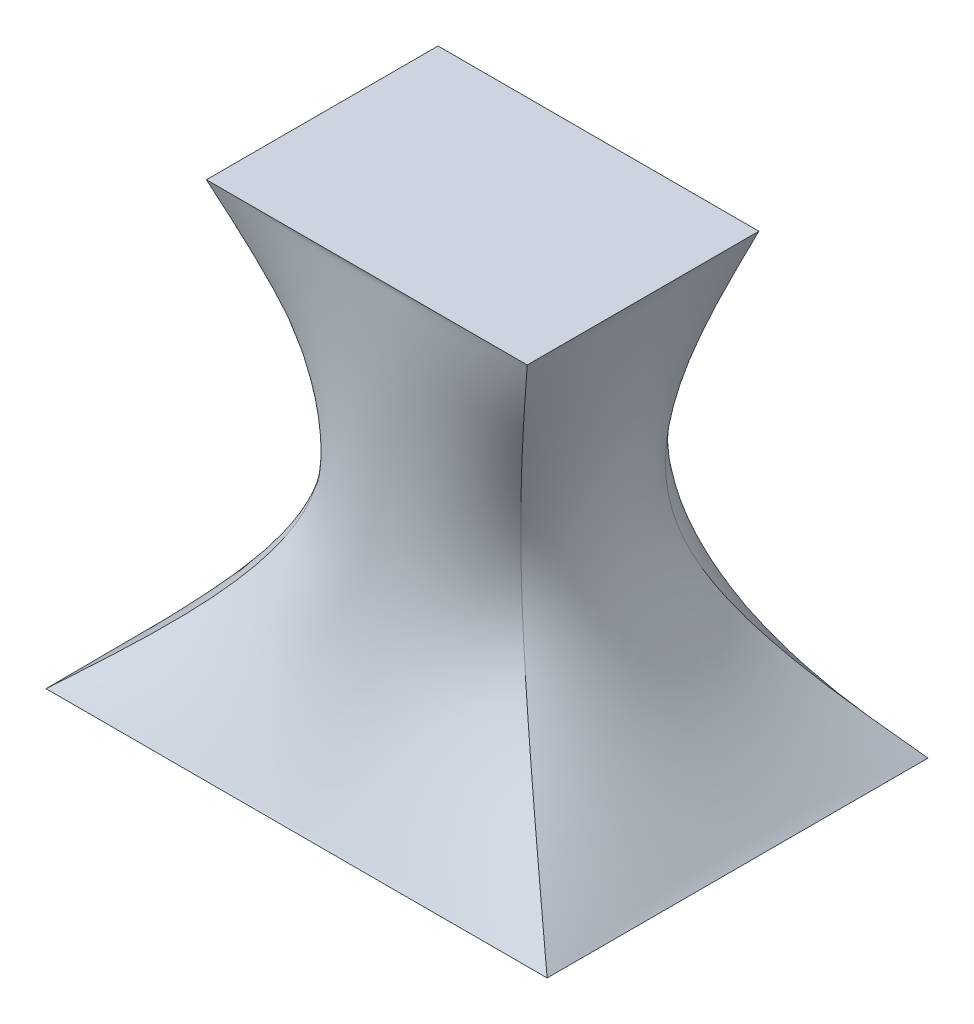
ISO-10303-21;
HEADER;
FILE_DESCRIPTION(('STEP AP214'),'2;1');
FILE_NAME('part.step','',(''),(''),'','','');
FILE_SCHEMA(('AUTOMOTIVE_DESIGN { 1 0 10303 214 1 1 1 1 }'));
ENDSEC;
DATA;
#1=APPLICATION_CONTEXT('core data for automotive mechanical design processes');
#2=APPLICATION_PROTOCOL_DEFINITION('international standard','automotive_design',2000,#1);
#3=PRODUCT_CONTEXT('',#1,'mechanical');
#4=PRODUCT('Part','Part','',(#3));
#5=PRODUCT_RELATED_PRODUCT_CATEGORY('part','',(#4));
#6=PRODUCT_DEFINITION_FORMATION('','',#4);
#7=PRODUCT_DEFINITION_CONTEXT('part definition',#1,'design');
#8=PRODUCT_DEFINITION('design','',#6,#7);
#9=PRODUCT_DEFINITION_SHAPE('','',#8);
#10=(LENGTH_UNIT() NAMED_UNIT(*) SI_UNIT(.MILLI.,.METRE.));
#11=(NAMED_UNIT(*) PLANE_ANGLE_UNIT() SI_UNIT($,.RADIAN.));
#12=(NAMED_UNIT(*) SI_UNIT($,.STERADIAN.) SOLID_ANGLE_UNIT());
#13=UNCERTAINTY_MEASURE_WITH_UNIT(LENGTH_MEASURE(1.E-05),#10,'distance_accuracy_value','');
#14=(GEOMETRIC_REPRESENTATION_CONTEXT(3) GLOBAL_UNCERTAINTY_ASSIGNED_CONTEXT((#13)) GLOBAL_UNIT_ASSIGNED_CONTEXT((#10,
#11,#12)) REPRESENTATION_CONTEXT('',''));
#15=CARTESIAN_POINT('',(0.,0.,0.));
#16=DIRECTION('',(0.,0.,1.));
#17=DIRECTION('',(1.,0.,0.));
#18=AXIS2_PLACEMENT_3D('',#15,#16,#17);
#19=CARTESIAN_POINT('',(-31.7563704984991,88.3809910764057,24.8139933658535));
#20=DIRECTION('',(0.,1.,0.));
#21=DIRECTION('',(0.,0.,1.));
#22=AXIS2_PLACEMENT_3D('',#19,#20,#21);
#23=PLANE('',#22);
#24=DIRECTION('',(0.,0.,1.));
#25=VECTOR('',#24,1.);
#26=CARTESIAN_POINT('',(-31.7563704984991,88.3809910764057,-20.532301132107));
#27=LINE('',#26,#25);
#28=CARTESIAN_POINT('',(-31.7563704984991,88.3809910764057,-20.532301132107));
#29=VERTEX_POINT('',#28);
#30=CARTESIAN_POINT('',(-31.7563704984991,88.3809910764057,24.8139933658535));
#31=VERTEX_POINT('',#30);
#32=EDGE_CURVE('E91',#29,#31,#27,.T.);
#33=ORIENTED_EDGE('',*,*,#32,.T.);
#34=DIRECTION('',(1.,0.,0.));
#35=VECTOR('',#34,1.);
#36=CARTESIAN_POINT('',(-31.7563704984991,88.3809910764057,24.8139933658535));
#37=LINE('',#36,#35);
#38=CARTESIAN_POINT('',(31.0591585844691,88.3809910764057,24.8139933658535));
#39=VERTEX_POINT('',#38);
#40=EDGE_CURVE('E108',#31,#39,#37,.T.);
#41=ORIENTED_EDGE('',*,*,#40,.T.);
#42=DIRECTION('',(0.,0.,-1.));
#43=VECTOR('',#42,1.);
#44=CARTESIAN_POINT('',(31.0591585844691,88.3809910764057,-20.532301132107));
#45=LINE('',#44,#43);
#46=CARTESIAN_POINT('',(31.0591585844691,88.3809910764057,-20.532301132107));
#47=VERTEX_POINT('',#46);
#48=EDGE_CURVE('E92',#39,#47,#45,.T.);
#49=ORIENTED_EDGE('',*,*,#48,.T.);
#50=DIRECTION('',(-1.,0.,0.));
#51=VECTOR('',#50,1.);
#52=CARTESIAN_POINT('',(-31.7563704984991,88.3809910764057,-20.532301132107));
#53=LINE('',#52,#51);
#54=EDGE_CURVE('E87',#47,#29,#53,.T.);
#55=ORIENTED_EDGE('',*,*,#54,.T.);
#56=EDGE_LOOP('',(#33,#41,#49,#55));
#57=FACE_BOUND('',#56,.T.);
#58=ADVANCED_FACE('F40',(#57),#23,.T.);
#59=CARTESIAN_POINT('',(-49.5440034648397,0.,38.4252172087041));
#60=DIRECTION('',(0.,1.,0.));
#61=DIRECTION('',(0.,0.,1.));
#62=AXIS2_PLACEMENT_3D('',#59,#60,#61);
#63=PLANE('',#62);
#64=DIRECTION('',(0.,0.,1.));
#65=VECTOR('',#64,1.);
#66=CARTESIAN_POINT('',(-49.5440034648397,0.,-36.1360553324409));
#67=LINE('',#66,#65);
#68=CARTESIAN_POINT('',(-49.5440034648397,0.,-36.1360553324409));
#69=VERTEX_POINT('',#68);
#70=CARTESIAN_POINT('',(-49.5440034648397,0.,38.4252172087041));
#71=VERTEX_POINT('',#70);
#72=EDGE_CURVE('E134',#69,#71,#67,.T.);
#73=ORIENTED_EDGE('',*,*,#72,.F.);
#74=DIRECTION('',(-1.,0.,0.));
#75=VECTOR('',#74,1.);
#76=CARTESIAN_POINT('',(-49.5440034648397,0.,-36.1360553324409));
#77=LINE('',#76,#75);
#78=CARTESIAN_POINT('',(48.5629340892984,0.,-36.1360553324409));
#79=VERTEX_POINT('',#78);
#80=EDGE_CURVE('E12',#79,#69,#77,.T.);
#81=ORIENTED_EDGE('',*,*,#80,.F.);
#82=DIRECTION('',(0.,0.,-1.));
#83=VECTOR('',#82,1.);
#84=CARTESIAN_POINT('',(48.5629340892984,0.,-36.1360553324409));
#85=LINE('',#84,#83);
#86=CARTESIAN_POINT('',(48.5629340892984,0.,38.4252172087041));
#87=VERTEX_POINT('',#86);
#88=EDGE_CURVE('E52',#87,#79,#85,.T.);
#89=ORIENTED_EDGE('',*,*,#88,.F.);
#90=DIRECTION('',(1.,0.,0.));
#91=VECTOR('',#90,1.);
#92=CARTESIAN_POINT('',(-49.5440034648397,0.,38.4252172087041));
#93=LINE('',#92,#91);
#94=EDGE_CURVE('E60',#71,#87,#93,.T.);
#95=ORIENTED_EDGE('',*,*,#94,.F.);
#96=EDGE_LOOP('',(#73,#81,#89,#95));
#97=FACE_BOUND('',#96,.T.);
#98=ADVANCED_FACE('F42',(#97),#63,.F.);
#99=CARTESIAN_POINT('',(48.5629340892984,0.,38.4252172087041));
#100=CARTESIAN_POINT('',(36.5326244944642,11.0374076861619,28.3981800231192));
#101=CARTESIAN_POINT('',(9.99117374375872,35.3883032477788,6.27637912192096));
#102=CARTESIAN_POINT('',(23.6121135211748,69.6493023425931,18.2613757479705));
#103=CARTESIAN_POINT('',(31.0591585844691,88.3809910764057,24.8139933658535));
#104=CARTESIAN_POINT('',(48.5629340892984,0.,13.5714596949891));
#105=CARTESIAN_POINT('',(39.7169107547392,11.0374076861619,10.354639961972));
#106=CARTESIAN_POINT('',(20.2006804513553,35.3883032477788,3.25764367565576));
#107=CARTESIAN_POINT('',(27.2209378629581,69.6493023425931,7.42184634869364));
#108=CARTESIAN_POINT('',(31.0591585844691,88.3809910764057,9.69856186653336));
#109=CARTESIAN_POINT('',(48.5629340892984,0.,-11.2822978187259));
#110=CARTESIAN_POINT('',(39.7169107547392,11.0374076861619,-9.26962336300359));
#111=CARTESIAN_POINT('',(20.2006804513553,35.3883032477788,-4.82923057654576));
#112=CARTESIAN_POINT('',(27.2209378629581,69.6493023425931,-5.20915282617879));
#113=CARTESIAN_POINT('',(31.0591585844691,88.3809910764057,-5.41686963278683));
#114=CARTESIAN_POINT('',(48.5629340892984,0.,-36.1360553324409));
#115=CARTESIAN_POINT('',(36.5326244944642,11.0374076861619,-27.3131634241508));
#116=CARTESIAN_POINT('',(9.99117374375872,35.3883032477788,-7.84796602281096));
#117=CARTESIAN_POINT('',(23.6121135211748,69.6493023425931,-16.0486822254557));
#118=CARTESIAN_POINT('',(31.0591585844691,88.3809910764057,-20.532301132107));
#119=B_SPLINE_SURFACE_WITH_KNOTS('',3,3,((#99,#100,#101,#102,#103),(#104,#105,#106,#107,#108),
(#109,#110,#111,#112,#113),(#114,#115,#116,#117,#118)),.UNSPECIFIED.,.F.,.F.,.F.,(4,4),(4,1,4),
(0.,1.),(0.,0.453264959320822,1.),.UNSPECIFIED.);
#120=CARTESIAN_POINT('',(48.5629340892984,0.,-36.1360553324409));
#121=CARTESIAN_POINT('',(36.5326244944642,11.0374076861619,-27.3131634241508));
#122=CARTESIAN_POINT('',(9.99117374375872,35.3883032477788,-7.84796602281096));
#123=CARTESIAN_POINT('',(23.6121135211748,69.6493023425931,-16.0486822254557));
#124=CARTESIAN_POINT('',(31.0591585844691,88.3809910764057,-20.532301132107));
#125=B_SPLINE_CURVE_WITH_KNOTS('',3,(#120,#121,#122,#123,#124),.UNSPECIFIED.,.F.,.F.,(4,1,4),
(0.,0.453264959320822,1.),.UNSPECIFIED.);
#126=EDGE_CURVE('E117',#79,#47,#125,.T.);
#127=CARTESIAN_POINT('',(48.5629340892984,0.,38.4252172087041));
#128=CARTESIAN_POINT('',(36.5326244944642,11.0374076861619,28.3981800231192));
#129=CARTESIAN_POINT('',(9.99117374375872,35.3883032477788,6.27637912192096));
#130=CARTESIAN_POINT('',(23.6121135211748,69.6493023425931,18.2613757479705));
#131=CARTESIAN_POINT('',(31.0591585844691,88.3809910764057,24.8139933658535));
#132=B_SPLINE_CURVE_WITH_KNOTS('',3,(#127,#128,#129,#130,#131),.UNSPECIFIED.,.F.,.F.,(4,1,4),
(0.,0.453264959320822,1.),.UNSPECIFIED.);
#133=EDGE_CURVE('E114',#39,#87,#132,.F.);
#134=ORIENTED_EDGE('',*,*,#88,.T.);
#135=ORIENTED_EDGE('',*,*,#126,.T.);
#136=ORIENTED_EDGE('',*,*,#48,.F.);
#137=ORIENTED_EDGE('',*,*,#133,.T.);
#138=EDGE_LOOP('',(#134,#135,#136,#137));
#139=FACE_BOUND('',#138,.T.);
#140=ADVANCED_FACE('F187',(#139),#119,.T.);
#141=CARTESIAN_POINT('',(48.5629340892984,0.,-36.1360553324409));
#142=CARTESIAN_POINT('',(36.5326244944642,11.0374076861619,-27.3131634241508));
#143=CARTESIAN_POINT('',(9.99117374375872,35.3883032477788,-7.84796602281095));
#144=CARTESIAN_POINT('',(23.6121135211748,69.6493023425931,-16.0486822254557));
#145=CARTESIAN_POINT('',(31.0591585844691,88.3809910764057,-20.532301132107));
#146=CARTESIAN_POINT('',(32.2117778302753,0.,-36.1360553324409));
#147=CARTESIAN_POINT('',(25.229593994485,11.0374076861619,-30.4088071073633));
#148=CARTESIAN_POINT('',(9.82539454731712,35.3883032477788,-17.7732655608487));
#149=CARTESIAN_POINT('',(16.7848988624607,69.6493023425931,-19.557045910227));
#150=CARTESIAN_POINT('',(20.5899037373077,88.3809910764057,-20.532301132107));
#151=CARTESIAN_POINT('',(15.8606215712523,0.,-36.1360553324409));
#152=CARTESIAN_POINT('',(12.5942103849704,11.0374076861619,-32.2350288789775));
#153=CARTESIAN_POINT('',(5.38780468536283,35.3883032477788,-23.6285253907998));
#154=CARTESIAN_POINT('',(8.44769799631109,69.6493023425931,-21.626744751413));
#155=CARTESIAN_POINT('',(10.1206488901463,88.3809910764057,-20.532301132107));
#156=CARTESIAN_POINT('',(-16.8416909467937,0.,-36.1360553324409));
#157=CARTESIAN_POINT('',(-13.1304768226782,11.0374076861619,-32.2350288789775));
#158=CARTESIAN_POINT('',(-4.94274016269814,35.3883032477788,-23.6285253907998));
#159=CARTESIAN_POINT('',(-8.74114162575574,69.6493023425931,-21.626744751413));
#160=CARTESIAN_POINT('',(-10.8178608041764,88.3809910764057,-20.532301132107));
#161=CARTESIAN_POINT('',(-33.1928472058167,0.,-36.1360553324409));
#162=CARTESIAN_POINT('',(-25.7658604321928,11.0374076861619,-30.4088071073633));
#163=CARTESIAN_POINT('',(-9.38033002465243,35.3883032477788,-17.7732655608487));
#164=CARTESIAN_POINT('',(-17.0783424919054,69.6493023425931,-19.557045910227));
#165=CARTESIAN_POINT('',(-21.2871156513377,88.3809910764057,-20.532301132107));
#166=CARTESIAN_POINT('',(-49.5440034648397,0.,-36.1360553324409));
#167=CARTESIAN_POINT('',(-37.0688909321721,11.0374076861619,-27.3131634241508));
#168=CARTESIAN_POINT('',(-9.54610922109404,35.3883032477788,-7.84796602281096));
#169=CARTESIAN_POINT('',(-23.9055571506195,69.6493023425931,-16.0486822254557));
#170=CARTESIAN_POINT('',(-31.7563704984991,88.3809910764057,-20.532301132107));
#171=B_SPLINE_SURFACE_WITH_KNOTS('',3,3,((#141,#142,#143,#144,#145),(#146,#147,#148,#149,#150),
(#151,#152,#153,#154,#155),(#156,#157,#158,#159,#160),(#161,#162,#163,#164,#165),(#166,#167,
#168,#169,#170)),.UNSPECIFIED.,.F.,.F.,.F.,(4,2,4),(4,1,4),(0.,0.5,1.),(0.,0.453264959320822,
1.),.UNSPECIFIED.);
#172=CARTESIAN_POINT('',(-49.5440034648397,0.,-36.1360553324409));
#173=CARTESIAN_POINT('',(-37.0688909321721,11.0374076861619,-27.3131634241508));
#174=CARTESIAN_POINT('',(-9.54610922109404,35.3883032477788,-7.84796602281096));
#175=CARTESIAN_POINT('',(-23.9055571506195,69.6493023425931,-16.0486822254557));
#176=CARTESIAN_POINT('',(-31.7563704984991,88.3809910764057,-20.532301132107));
#177=B_SPLINE_CURVE_WITH_KNOTS('',3,(#172,#173,#174,#175,#176),.UNSPECIFIED.,.F.,.F.,(4,1,4),
(0.,0.453264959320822,1.),.UNSPECIFIED.);
#178=EDGE_CURVE('E106',#69,#29,#177,.T.);
#179=ORIENTED_EDGE('',*,*,#80,.T.);
#180=ORIENTED_EDGE('',*,*,#178,.T.);
#181=ORIENTED_EDGE('',*,*,#54,.F.);
#182=ORIENTED_EDGE('',*,*,#126,.F.);
#183=EDGE_LOOP('',(#179,#180,#181,#182));
#184=FACE_BOUND('',#183,.T.);
#185=ADVANCED_FACE('F112',(#184),#171,.T.);
#186=CARTESIAN_POINT('',(-49.5440034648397,0.,38.4252172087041));
#187=CARTESIAN_POINT('',(-37.0688909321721,11.0374076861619,28.3981800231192));
#188=CARTESIAN_POINT('',(-9.54610922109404,35.3883032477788,6.27637912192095));
#189=CARTESIAN_POINT('',(-23.9055571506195,69.6493023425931,18.2613757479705));
#190=CARTESIAN_POINT('',(-31.7563704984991,88.3809910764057,24.8139933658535));
#191=CARTESIAN_POINT('',(-33.1928472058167,0.,38.4252172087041));
#192=CARTESIAN_POINT('',(-25.7658604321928,11.0374076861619,31.4938237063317));
#193=CARTESIAN_POINT('',(-9.38033002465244,35.3883032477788,16.2016786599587));
#194=CARTESIAN_POINT('',(-17.0783424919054,69.6493023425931,21.7697394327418));
#195=CARTESIAN_POINT('',(-21.2871156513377,88.3809910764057,24.8139933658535));
#196=CARTESIAN_POINT('',(-16.8416909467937,0.,38.4252172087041));
#197=CARTESIAN_POINT('',(-13.1304768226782,11.0374076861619,33.3200454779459));
#198=CARTESIAN_POINT('',(-4.94274016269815,35.3883032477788,22.0569384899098));
#199=CARTESIAN_POINT('',(-8.74114162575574,69.6493023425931,23.8394382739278));
#200=CARTESIAN_POINT('',(-10.8178608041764,88.3809910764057,24.8139933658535));
#201=CARTESIAN_POINT('',(15.8606215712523,0.,38.4252172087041));
#202=CARTESIAN_POINT('',(12.5942103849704,11.0374076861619,33.3200454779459));
#203=CARTESIAN_POINT('',(5.38780468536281,35.3883032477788,22.0569384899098));
#204=CARTESIAN_POINT('',(8.44769799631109,69.6493023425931,23.8394382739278));
#205=CARTESIAN_POINT('',(10.1206488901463,88.3809910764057,24.8139933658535));
#206=CARTESIAN_POINT('',(32.2117778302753,0.,38.4252172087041));
#207=CARTESIAN_POINT('',(25.229593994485,11.0374076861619,31.4938237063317));
#208=CARTESIAN_POINT('',(9.8253945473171,35.3883032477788,16.2016786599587));
#209=CARTESIAN_POINT('',(16.7848988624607,69.6493023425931,21.7697394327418));
#210=CARTESIAN_POINT('',(20.5899037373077,88.3809910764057,24.8139933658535));
#211=CARTESIAN_POINT('',(48.5629340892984,0.,38.4252172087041));
#212=CARTESIAN_POINT('',(36.5326244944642,11.0374076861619,28.3981800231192));
#213=CARTESIAN_POINT('',(9.99117374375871,35.3883032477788,6.27637912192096));
#214=CARTESIAN_POINT('',(23.6121135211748,69.6493023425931,18.2613757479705));
#215=CARTESIAN_POINT('',(31.0591585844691,88.3809910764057,24.8139933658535));
#216=B_SPLINE_SURFACE_WITH_KNOTS('',3,3,((#186,#187,#188,#189,#190),(#191,#192,#193,#194,#195),
(#196,#197,#198,#199,#200),(#201,#202,#203,#204,#205),(#206,#207,#208,#209,#210),(#211,#212,
#213,#214,#215)),.UNSPECIFIED.,.F.,.F.,.F.,(4,2,4),(4,1,4),(0.,0.5,1.),(0.,0.453264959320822,
1.),.UNSPECIFIED.);
#217=CARTESIAN_POINT('',(-49.5440034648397,0.,38.4252172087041));
#218=CARTESIAN_POINT('',(-37.0688909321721,11.0374076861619,28.3981800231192));
#219=CARTESIAN_POINT('',(-9.54610922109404,35.3883032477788,6.27637912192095));
#220=CARTESIAN_POINT('',(-23.9055571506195,69.6493023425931,18.2613757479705));
#221=CARTESIAN_POINT('',(-31.7563704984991,88.3809910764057,24.8139933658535));
#222=B_SPLINE_CURVE_WITH_KNOTS('',3,(#217,#218,#219,#220,#221),.UNSPECIFIED.,.F.,.F.,(4,1,4),
(0.,0.453264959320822,1.),.UNSPECIFIED.);
#223=EDGE_CURVE('E98',#71,#31,#222,.T.);
#224=ORIENTED_EDGE('',*,*,#94,.T.);
#225=ORIENTED_EDGE('',*,*,#133,.F.);
#226=ORIENTED_EDGE('',*,*,#40,.F.);
#227=ORIENTED_EDGE('',*,*,#223,.F.);
#228=EDGE_LOOP('',(#224,#225,#226,#227));
#229=FACE_BOUND('',#228,.T.);
#230=ADVANCED_FACE('F149',(#229),#216,.T.);
#231=CARTESIAN_POINT('',(-49.5440034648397,0.,-36.1360553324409));
#232=CARTESIAN_POINT('',(-37.0688909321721,11.0374076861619,-27.3131634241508));
#233=CARTESIAN_POINT('',(-9.54610922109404,35.3883032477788,-7.84796602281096));
#234=CARTESIAN_POINT('',(-23.9055571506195,69.6493023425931,-16.0486822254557));
#235=CARTESIAN_POINT('',(-31.7563704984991,88.3809910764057,-20.532301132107));
#236=CARTESIAN_POINT('',(-49.5440034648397,0.,-11.2822978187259));
#237=CARTESIAN_POINT('',(-40.2531771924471,11.0374076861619,-9.2696233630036));
#238=CARTESIAN_POINT('',(-19.7556159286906,35.3883032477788,-4.82923057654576));
#239=CARTESIAN_POINT('',(-27.5143814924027,69.6493023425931,-5.20915282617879));
#240=CARTESIAN_POINT('',(-31.7563704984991,88.3809910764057,-5.41686963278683));
#241=CARTESIAN_POINT('',(-49.5440034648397,0.,13.5714596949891));
#242=CARTESIAN_POINT('',(-40.2531771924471,11.0374076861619,10.354639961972));
#243=CARTESIAN_POINT('',(-19.7556159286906,35.3883032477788,3.25764367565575));
#244=CARTESIAN_POINT('',(-27.5143814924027,69.6493023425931,7.42184634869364));
#245=CARTESIAN_POINT('',(-31.7563704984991,88.3809910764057,9.69856186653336));
#246=CARTESIAN_POINT('',(-49.5440034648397,0.,38.4252172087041));
#247=CARTESIAN_POINT('',(-37.0688909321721,11.0374076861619,28.3981800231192));
#248=CARTESIAN_POINT('',(-9.54610922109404,35.3883032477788,6.27637912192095));
#249=CARTESIAN_POINT('',(-23.9055571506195,69.6493023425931,18.2613757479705));
#250=CARTESIAN_POINT('',(-31.7563704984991,88.3809910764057,24.8139933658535));
#251=B_SPLINE_SURFACE_WITH_KNOTS('',3,3,((#231,#232,#233,#234,#235),(#236,#237,#238,#239,#240),
(#241,#242,#243,#244,#245),(#246,#247,#248,#249,#250)),.UNSPECIFIED.,.F.,.F.,.F.,(4,4),(4,1,4),
(0.,1.),(0.,0.453264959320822,1.),.UNSPECIFIED.);
#252=ORIENTED_EDGE('',*,*,#72,.T.);
#253=ORIENTED_EDGE('',*,*,#223,.T.);
#254=ORIENTED_EDGE('',*,*,#32,.F.);
#255=ORIENTED_EDGE('',*,*,#178,.F.);
#256=EDGE_LOOP('',(#252,#253,#254,#255));
#257=FACE_BOUND('',#256,.T.);
#258=ADVANCED_FACE('F105',(#257),#251,.T.);
#259=CLOSED_SHELL('',(#58,#98,#140,#185,#230,#258));
#260=MANIFOLD_SOLID_BREP('B2',#259);
#261=ADVANCED_BREP_SHAPE_REPRESENTATION('',(#18,#260),#14);
#262=SHAPE_DEFINITION_REPRESENTATION(#9,#261);
ENDSEC;
END-ISO-10303-21;
